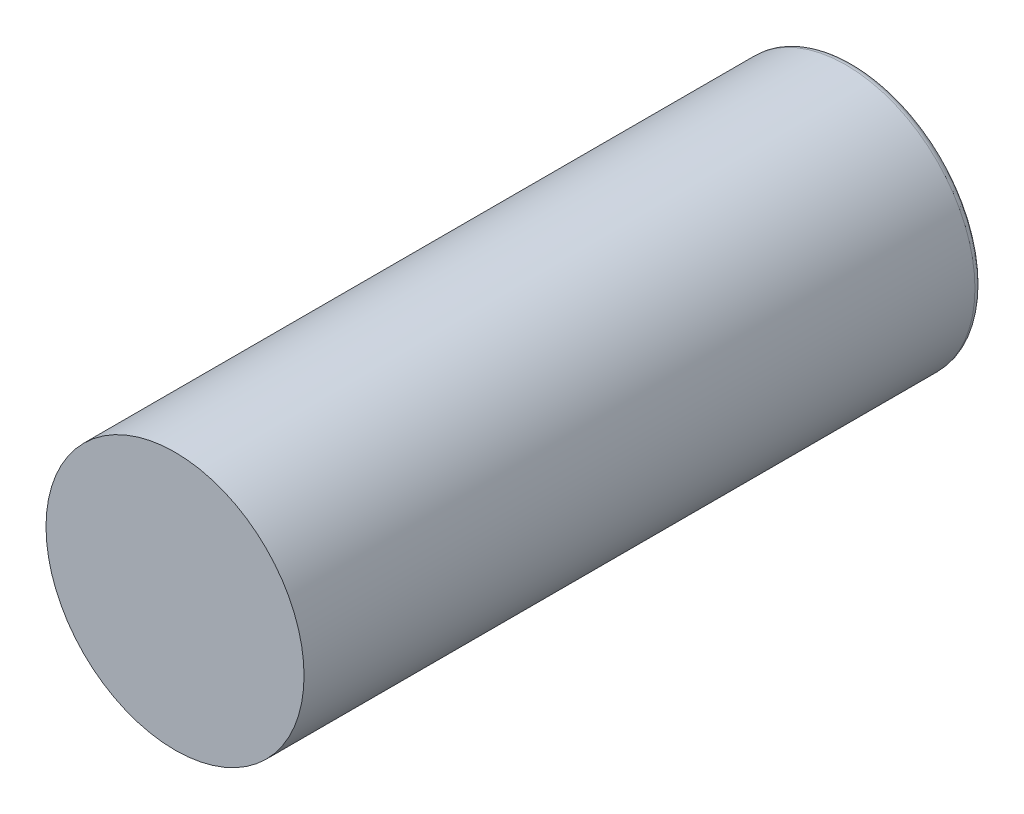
ISO-10303-21;
HEADER;
FILE_DESCRIPTION(('STEP AP214'),'2;1');
FILE_NAME('part.step','',(''),(''),'','','');
FILE_SCHEMA(('AUTOMOTIVE_DESIGN { 1 0 10303 214 1 1 1 1 }'));
ENDSEC;
DATA;
#1=APPLICATION_CONTEXT('core data for automotive mechanical design processes');
#2=APPLICATION_PROTOCOL_DEFINITION('international standard','automotive_design',2000,#1);
#3=PRODUCT_CONTEXT('',#1,'mechanical');
#4=PRODUCT('Part','Part','',(#3));
#5=PRODUCT_RELATED_PRODUCT_CATEGORY('part','',(#4));
#6=PRODUCT_DEFINITION_FORMATION('','',#4);
#7=PRODUCT_DEFINITION_CONTEXT('part definition',#1,'design');
#8=PRODUCT_DEFINITION('design','',#6,#7);
#9=PRODUCT_DEFINITION_SHAPE('','',#8);
#10=(LENGTH_UNIT() NAMED_UNIT(*) SI_UNIT(.MILLI.,.METRE.));
#11=(NAMED_UNIT(*) PLANE_ANGLE_UNIT() SI_UNIT($,.RADIAN.));
#12=(NAMED_UNIT(*) SI_UNIT($,.STERADIAN.) SOLID_ANGLE_UNIT());
#13=UNCERTAINTY_MEASURE_WITH_UNIT(LENGTH_MEASURE(1.E-05),#10,'distance_accuracy_value','');
#14=(GEOMETRIC_REPRESENTATION_CONTEXT(3) GLOBAL_UNCERTAINTY_ASSIGNED_CONTEXT((#13)) GLOBAL_UNIT_ASSIGNED_CONTEXT((#10,
#11,#12)) REPRESENTATION_CONTEXT('',''));
#15=CARTESIAN_POINT('',(0.,0.,0.));
#16=DIRECTION('',(0.,0.,1.));
#17=DIRECTION('',(1.,0.,0.));
#18=AXIS2_PLACEMENT_3D('',#15,#16,#17);
#19=CARTESIAN_POINT('',(-7.084,-7.0978,36.));
#20=DIRECTION('',(0.,0.,1.));
#21=DIRECTION('',(0.,-1.,0.));
#22=AXIS2_PLACEMENT_3D('',#19,#20,#21);
#23=PLANE('',#22);
#24=CARTESIAN_POINT('',(0.,0.,36.));
#25=DIRECTION('',(0.,0.,-1.));
#26=DIRECTION('',(-1.,0.,0.));
#27=AXIS2_PLACEMENT_3D('',#24,#25,#26);
#28=CIRCLE('',#27,7.);
#29=CARTESIAN_POINT('',(2.50000000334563,6.53834841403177,36.));
#30=VERTEX_POINT('',#29);
#31=CARTESIAN_POINT('',(-2.5,6.53834841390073,36.));
#32=VERTEX_POINT('',#31);
#33=EDGE_CURVE('E20',#30,#32,#28,.T.);
#34=ORIENTED_EDGE('',*,*,#33,.T.);
#35=DIRECTION('',(0.,1.,0.));
#36=VECTOR('',#35,1.);
#37=CARTESIAN_POINT('',(-2.5,9.3,36.));
#38=LINE('',#37,#36);
#39=CARTESIAN_POINT('',(-2.5,9.3,36.));
#40=VERTEX_POINT('',#39);
#41=EDGE_CURVE('E61',#32,#40,#38,.T.);
#42=ORIENTED_EDGE('',*,*,#41,.T.);
#43=DIRECTION('',(1.,0.,0.));
#44=VECTOR('',#43,1.);
#45=CARTESIAN_POINT('',(2.50000000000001,9.3,36.));
#46=LINE('',#45,#44);
#47=CARTESIAN_POINT('',(2.5,9.29999999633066,36.));
#48=VERTEX_POINT('',#47);
#49=EDGE_CURVE('E55',#40,#48,#46,.T.);
#50=ORIENTED_EDGE('',*,*,#49,.T.);
#51=DIRECTION('',(0.,1.,0.));
#52=VECTOR('',#51,1.);
#53=CARTESIAN_POINT('',(2.50000000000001,6.538348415,36.));
#54=LINE('',#53,#52);
#55=EDGE_CURVE('E49',#48,#30,#54,.F.);
#56=ORIENTED_EDGE('',*,*,#55,.T.);
#57=EDGE_LOOP('',(#34,#42,#50,#56));
#58=FACE_BOUND('',#57,.T.);
#59=ADVANCED_FACE('F16',(#58),#23,.F.);
#60=CARTESIAN_POINT('',(2.50000000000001,9.3,5.00000000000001));
#61=DIRECTION('',(0.,1.,0.));
#62=DIRECTION('',(0.,0.,1.));
#63=AXIS2_PLACEMENT_3D('',#60,#61,#62);
#64=PLANE('',#63);
#65=DIRECTION('',(0.,0.,1.));
#66=VECTOR('',#65,1.);
#67=CARTESIAN_POINT('',(2.50000000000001,9.299999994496,5.00000000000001));
#68=LINE('',#67,#66);
#69=CARTESIAN_POINT('',(2.50000000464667,9.299999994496,5.));
#70=VERTEX_POINT('',#69);
#71=EDGE_CURVE('E72',#70,#48,#68,.T.);
#72=ORIENTED_EDGE('',*,*,#71,.T.);
#73=ORIENTED_EDGE('',*,*,#49,.F.);
#74=DIRECTION('',(0.,0.,1.));
#75=VECTOR('',#74,1.);
#76=CARTESIAN_POINT('',(-2.49999999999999,9.3,5.));
#77=LINE('',#76,#75);
#78=CARTESIAN_POINT('',(-2.50000000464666,9.29999999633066,5.));
#79=VERTEX_POINT('',#78);
#80=EDGE_CURVE('E66',#40,#79,#77,.F.);
#81=ORIENTED_EDGE('',*,*,#80,.T.);
#82=DIRECTION('',(1.,0.,0.));
#83=VECTOR('',#82,1.);
#84=CARTESIAN_POINT('',(-16.698,9.299999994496,5.));
#85=LINE('',#84,#83);
#86=EDGE_CURVE('E69',#79,#70,#85,.T.);
#87=ORIENTED_EDGE('',*,*,#86,.T.);
#88=EDGE_LOOP('',(#72,#73,#81,#87));
#89=FACE_BOUND('',#88,.T.);
#90=ADVANCED_FACE('F71',(#89),#64,.F.);
#91=CARTESIAN_POINT('',(2.50000000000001,6.538348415,5.00000000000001));
#92=DIRECTION('',(1.,0.,0.));
#93=DIRECTION('',(0.,1.,0.));
#94=AXIS2_PLACEMENT_3D('',#91,#92,#93);
#95=PLANE('',#94);
#96=DIRECTION('',(0.,0.,-1.));
#97=VECTOR('',#96,1.);
#98=CARTESIAN_POINT('',(2.50000000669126,6.53834841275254,36.));
#99=LINE('',#98,#97);
#100=CARTESIAN_POINT('',(2.50000000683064,6.53834841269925,5.));
#101=VERTEX_POINT('',#100);
#102=EDGE_CURVE('E124',#101,#30,#99,.F.);
#103=ORIENTED_EDGE('',*,*,#102,.T.);
#104=ORIENTED_EDGE('',*,*,#55,.F.);
#105=ORIENTED_EDGE('',*,*,#71,.F.);
#106=DIRECTION('',(0.,-1.,0.));
#107=VECTOR('',#106,1.);
#108=CARTESIAN_POINT('',(2.50000000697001,-16.698,5.));
#109=LINE('',#108,#107);
#110=EDGE_CURVE('E77',#70,#101,#109,.T.);
#111=ORIENTED_EDGE('',*,*,#110,.T.);
#112=EDGE_LOOP('',(#103,#104,#105,#111));
#113=FACE_BOUND('',#112,.T.);
#114=ADVANCED_FACE('F80',(#113),#95,.F.);
#115=CARTESIAN_POINT('',(0.,0.,36.));
#116=DIRECTION('',(0.,0.,-1.));
#117=DIRECTION('',(-1.,0.,0.));
#118=AXIS2_PLACEMENT_3D('',#115,#116,#117);
#119=CYLINDRICAL_SURFACE('',#118,7.);
#120=ORIENTED_EDGE('',*,*,#102,.F.);
#121=CARTESIAN_POINT('',(0.,0.,5.));
#122=DIRECTION('',(0.,0.,-1.));
#123=DIRECTION('',(-1.,0.,0.));
#124=AXIS2_PLACEMENT_3D('',#121,#122,#123);
#125=CIRCLE('',#124,7.);
#126=CARTESIAN_POINT('',(-2.50000000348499,6.53834841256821,5.));
#127=VERTEX_POINT('',#126);
#128=EDGE_CURVE('E36',#101,#127,#125,.T.);
#129=ORIENTED_EDGE('',*,*,#128,.T.);
#130=DIRECTION('',(0.,0.,1.));
#131=VECTOR('',#130,1.);
#132=CARTESIAN_POINT('',(-2.49999999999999,6.53834841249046,5.));
#133=LINE('',#132,#131);
#134=EDGE_CURVE('E111',#127,#32,#133,.T.);
#135=ORIENTED_EDGE('',*,*,#134,.T.);
#136=ORIENTED_EDGE('',*,*,#33,.F.);
#137=EDGE_LOOP('',(#120,#129,#135,#136));
#138=FACE_BOUND('',#137,.T.);
#139=ADVANCED_FACE('F166',(#138),#119,.F.);
#140=CARTESIAN_POINT('',(-2.49999999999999,9.3,5.));
#141=DIRECTION('',(-1.,0.,0.));
#142=DIRECTION('',(0.,0.,1.));
#143=AXIS2_PLACEMENT_3D('',#140,#141,#142);
#144=PLANE('',#143);
#145=ORIENTED_EDGE('',*,*,#80,.F.);
#146=ORIENTED_EDGE('',*,*,#41,.F.);
#147=ORIENTED_EDGE('',*,*,#134,.F.);
#148=DIRECTION('',(0.,-1.,0.));
#149=VECTOR('',#148,1.);
#150=CARTESIAN_POINT('',(-2.50000000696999,-16.698,5.));
#151=LINE('',#150,#149);
#152=EDGE_CURVE('E90',#127,#79,#151,.F.);
#153=ORIENTED_EDGE('',*,*,#152,.T.);
#154=EDGE_LOOP('',(#145,#146,#147,#153));
#155=FACE_BOUND('',#154,.T.);
#156=ADVANCED_FACE('F162',(#155),#144,.F.);
#157=CARTESIAN_POINT('',(-16.698,-16.698,5.));
#158=DIRECTION('',(0.,0.,1.));
#159=DIRECTION('',(0.,-1.,0.));
#160=AXIS2_PLACEMENT_3D('',#157,#158,#159);
#161=PLANE('',#160);
#162=CARTESIAN_POINT('',(0.,0.,5.00000000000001));
#163=DIRECTION('',(0.,0.,1.));
#164=DIRECTION('',(1.,0.,0.));
#165=AXIS2_PLACEMENT_3D('',#162,#163,#164);
#166=CIRCLE('',#165,16.5000000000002);
#167=CARTESIAN_POINT('',(16.5000000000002,0.,5.00000000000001));
#168=VERTEX_POINT('',#167);
#169=EDGE_CURVE('E142',#168,#168,#166,.T.);
#170=ORIENTED_EDGE('',*,*,#169,.F.);
#171=EDGE_LOOP('',(#170));
#172=FACE_BOUND('',#171,.T.);
#173=ORIENTED_EDGE('',*,*,#128,.F.);
#174=ORIENTED_EDGE('',*,*,#110,.F.);
#175=ORIENTED_EDGE('',*,*,#86,.F.);
#176=ORIENTED_EDGE('',*,*,#152,.F.);
#177=EDGE_LOOP('',(#173,#174,#175,#176));
#178=FACE_BOUND('',#177,.T.);
#179=ADVANCED_FACE('F83',(#172,#178),#161,.F.);
#180=CARTESIAN_POINT('',(17.71,-17.71,97.));
#181=DIRECTION('',(0.,0.,-1.));
#182=DIRECTION('',(-1.,0.,0.));
#183=AXIS2_PLACEMENT_3D('',#180,#181,#182);
#184=PLANE('',#183);
#185=CARTESIAN_POINT('',(0.,0.,97.));
#186=DIRECTION('',(0.,0.,-1.));
#187=DIRECTION('',(-1.,0.,0.));
#188=AXIS2_PLACEMENT_3D('',#185,#186,#187);
#189=CIRCLE('',#188,17.5);
#190=CARTESIAN_POINT('',(-17.5,0.,97.));
#191=VERTEX_POINT('',#190);
#192=EDGE_CURVE('E27',#191,#191,#189,.T.);
#193=ORIENTED_EDGE('',*,*,#192,.F.);
#194=EDGE_LOOP('',(#193));
#195=FACE_BOUND('',#194,.T.);
#196=ADVANCED_FACE('F103',(#195),#184,.F.);
#197=CARTESIAN_POINT('',(0.,0.,6.00000000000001));
#198=DIRECTION('',(0.,0.,-1.));
#199=DIRECTION('',(-1.,0.,0.));
#200=AXIS2_PLACEMENT_3D('',#197,#198,#199);
#201=TOROIDAL_SURFACE('',#200,16.5,1.);
#202=CARTESIAN_POINT('',(0.,0.,6.00000000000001));
#203=DIRECTION('',(0.,0.,-1.));
#204=DIRECTION('',(-1.,0.,0.));
#205=AXIS2_PLACEMENT_3D('',#202,#203,#204);
#206=CIRCLE('',#205,17.5);
#207=CARTESIAN_POINT('',(-17.5,0.,6.));
#208=VERTEX_POINT('',#207);
#209=EDGE_CURVE('E11',#208,#208,#206,.F.);
#210=ORIENTED_EDGE('',*,*,#209,.F.);
#211=EDGE_LOOP('',(#210));
#212=FACE_BOUND('',#211,.T.);
#213=ORIENTED_EDGE('',*,*,#169,.T.);
#214=EDGE_LOOP('',(#213));
#215=FACE_BOUND('',#214,.T.);
#216=ADVANCED_FACE('F99',(#212,#215),#201,.T.);
#217=CARTESIAN_POINT('',(0.,0.,97.));
#218=DIRECTION('',(0.,0.,-1.));
#219=DIRECTION('',(-1.,0.,0.));
#220=AXIS2_PLACEMENT_3D('',#217,#218,#219);
#221=CYLINDRICAL_SURFACE('',#220,17.5);
#222=ORIENTED_EDGE('',*,*,#192,.T.);
#223=EDGE_LOOP('',(#222));
#224=FACE_BOUND('',#223,.T.);
#225=ORIENTED_EDGE('',*,*,#209,.T.);
#226=EDGE_LOOP('',(#225));
#227=FACE_BOUND('',#226,.T.);
#228=ADVANCED_FACE('F18',(#224,#227),#221,.T.);
#229=CLOSED_SHELL('',(#59,#90,#114,#139,#156,#179,#196,#216,#228));
#230=MANIFOLD_SOLID_BREP('B1',#229);
#231=ADVANCED_BREP_SHAPE_REPRESENTATION('',(#18,#230),#14);
#232=SHAPE_DEFINITION_REPRESENTATION(#9,#231);
ENDSEC;
END-ISO-10303-21;
